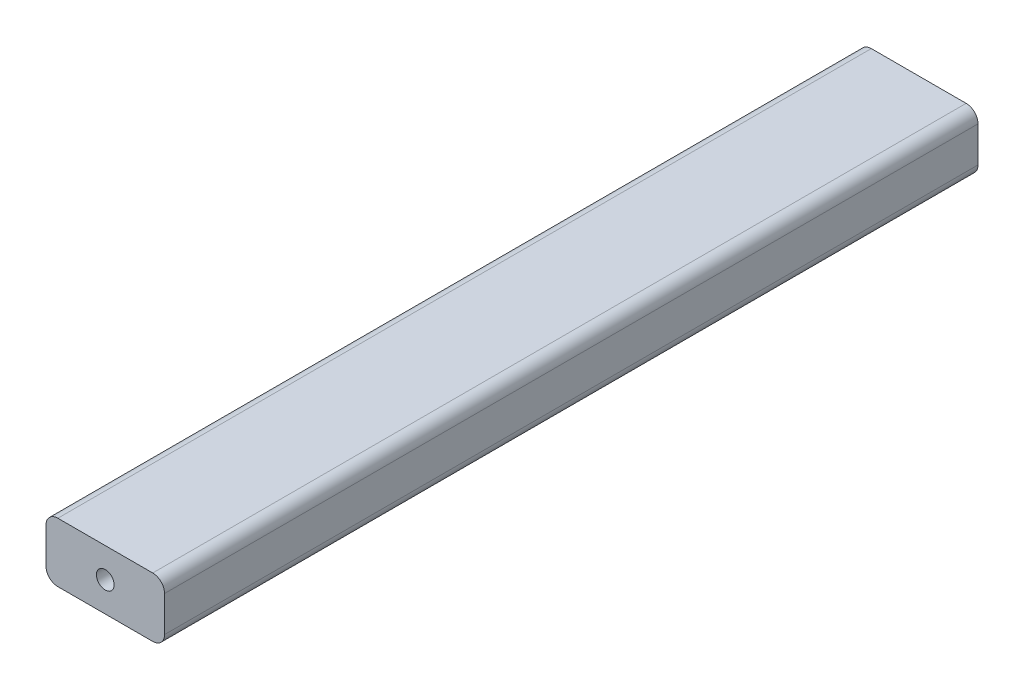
ISO-10303-21;
HEADER;
FILE_DESCRIPTION(('STEP AP214'),'2;1');
FILE_NAME('part.step','',(''),(''),'','','');
FILE_SCHEMA(('AUTOMOTIVE_DESIGN { 1 0 10303 214 1 1 1 1 }'));
ENDSEC;
DATA;
#1=APPLICATION_CONTEXT('core data for automotive mechanical design processes');
#2=APPLICATION_PROTOCOL_DEFINITION('international standard','automotive_design',2000,#1);
#3=PRODUCT_CONTEXT('',#1,'mechanical');
#4=PRODUCT('Part','Part','',(#3));
#5=PRODUCT_RELATED_PRODUCT_CATEGORY('part','',(#4));
#6=PRODUCT_DEFINITION_FORMATION('','',#4);
#7=PRODUCT_DEFINITION_CONTEXT('part definition',#1,'design');
#8=PRODUCT_DEFINITION('design','',#6,#7);
#9=PRODUCT_DEFINITION_SHAPE('','',#8);
#10=(LENGTH_UNIT() NAMED_UNIT(*) SI_UNIT(.MILLI.,.METRE.));
#11=(NAMED_UNIT(*) PLANE_ANGLE_UNIT() SI_UNIT($,.RADIAN.));
#12=(NAMED_UNIT(*) SI_UNIT($,.STERADIAN.) SOLID_ANGLE_UNIT());
#13=UNCERTAINTY_MEASURE_WITH_UNIT(LENGTH_MEASURE(1.E-05),#10,'distance_accuracy_value','');
#14=(GEOMETRIC_REPRESENTATION_CONTEXT(3) GLOBAL_UNCERTAINTY_ASSIGNED_CONTEXT((#13)) GLOBAL_UNIT_ASSIGNED_CONTEXT((#10,
#11,#12)) REPRESENTATION_CONTEXT('',''));
#15=CARTESIAN_POINT('',(0.,0.,0.));
#16=DIRECTION('',(0.,0.,1.));
#17=DIRECTION('',(1.,0.,0.));
#18=AXIS2_PLACEMENT_3D('',#15,#16,#17);
#19=CARTESIAN_POINT('',(-13.5890000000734,53.4416000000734,87.1347));
#20=DIRECTION('',(1.,0.,0.));
#21=DIRECTION('',(0.,1.,0.));
#22=AXIS2_PLACEMENT_3D('',#19,#20,#21);
#23=PLANE('',#22);
#24=DIRECTION('',(0.,-1.,0.));
#25=VECTOR('',#24,1.);
#26=CARTESIAN_POINT('',(-13.5890000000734,53.4416000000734,-87.1347));
#27=LINE('',#26,#25);
#28=CARTESIAN_POINT('',(-13.5890000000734,50.9016000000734,-87.1347));
#29=VERTEX_POINT('',#28);
#30=CARTESIAN_POINT('',(-13.5890000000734,43.2816000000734,-87.1347));
#31=VERTEX_POINT('',#30);
#32=EDGE_CURVE('E130',#29,#31,#27,.T.);
#33=ORIENTED_EDGE('',*,*,#32,.T.);
#34=DIRECTION('',(0.,0.,-1.));
#35=VECTOR('',#34,1.);
#36=CARTESIAN_POINT('',(-13.5890000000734,43.2816000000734,87.1347));
#37=LINE('',#36,#35);
#38=CARTESIAN_POINT('',(-13.5890000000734,43.2816000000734,87.1347));
#39=VERTEX_POINT('',#38);
#40=EDGE_CURVE('E167',#31,#39,#37,.F.);
#41=ORIENTED_EDGE('',*,*,#40,.T.);
#42=DIRECTION('',(0.,-1.,0.));
#43=VECTOR('',#42,1.);
#44=CARTESIAN_POINT('',(-13.5890000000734,53.4416000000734,87.1347));
#45=LINE('',#44,#43);
#46=CARTESIAN_POINT('',(-13.5890000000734,50.9016000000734,87.1347));
#47=VERTEX_POINT('',#46);
#48=EDGE_CURVE('E131',#47,#39,#45,.T.);
#49=ORIENTED_EDGE('',*,*,#48,.F.);
#50=DIRECTION('',(0.,0.,-1.));
#51=VECTOR('',#50,1.);
#52=CARTESIAN_POINT('',(-13.5890000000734,50.9016000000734,87.1347));
#53=LINE('',#52,#51);
#54=EDGE_CURVE('E164',#47,#29,#53,.T.);
#55=ORIENTED_EDGE('',*,*,#54,.T.);
#56=EDGE_LOOP('',(#33,#41,#49,#55));
#57=FACE_BOUND('',#56,.T.);
#58=ADVANCED_FACE('F38',(#57),#23,.F.);
#59=CARTESIAN_POINT('',(-13.5890000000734,40.7416000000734,87.1347));
#60=DIRECTION('',(0.,1.,0.));
#61=DIRECTION('',(0.,0.,1.));
#62=AXIS2_PLACEMENT_3D('',#59,#60,#61);
#63=PLANE('',#62);
#64=DIRECTION('',(1.,0.,0.));
#65=VECTOR('',#64,1.);
#66=CARTESIAN_POINT('',(-13.5890000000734,40.7416000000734,87.1347));
#67=LINE('',#66,#65);
#68=CARTESIAN_POINT('',(-11.0490000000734,40.7416000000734,87.1347));
#69=VERTEX_POINT('',#68);
#70=CARTESIAN_POINT('',(9.27099999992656,40.7416000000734,87.1347));
#71=VERTEX_POINT('',#70);
#72=EDGE_CURVE('E134',#69,#71,#67,.T.);
#73=ORIENTED_EDGE('',*,*,#72,.F.);
#74=DIRECTION('',(0.,0.,-1.));
#75=VECTOR('',#74,1.);
#76=CARTESIAN_POINT('',(-11.0490000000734,40.7416000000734,87.1347));
#77=LINE('',#76,#75);
#78=CARTESIAN_POINT('',(-11.0490000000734,40.7416000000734,-87.1347));
#79=VERTEX_POINT('',#78);
#80=EDGE_CURVE('E153',#69,#79,#77,.T.);
#81=ORIENTED_EDGE('',*,*,#80,.T.);
#82=DIRECTION('',(1.,0.,0.));
#83=VECTOR('',#82,1.);
#84=CARTESIAN_POINT('',(-13.5890000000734,40.7416000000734,-87.1347));
#85=LINE('',#84,#83);
#86=CARTESIAN_POINT('',(9.27099999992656,40.7416000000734,-87.1347));
#87=VERTEX_POINT('',#86);
#88=EDGE_CURVE('E145',#79,#87,#85,.T.);
#89=ORIENTED_EDGE('',*,*,#88,.T.);
#90=DIRECTION('',(0.,0.,-1.));
#91=VECTOR('',#90,1.);
#92=CARTESIAN_POINT('',(9.27099999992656,40.7416000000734,87.1347));
#93=LINE('',#92,#91);
#94=EDGE_CURVE('E142',#87,#71,#93,.F.);
#95=ORIENTED_EDGE('',*,*,#94,.T.);
#96=EDGE_LOOP('',(#73,#81,#89,#95));
#97=FACE_BOUND('',#96,.T.);
#98=ADVANCED_FACE('F208',(#97),#63,.F.);
#99=CARTESIAN_POINT('',(11.8109999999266,53.4416000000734,87.1347));
#100=DIRECTION('',(-1.,0.,0.));
#101=DIRECTION('',(0.,-1.,0.));
#102=AXIS2_PLACEMENT_3D('',#99,#100,#101);
#103=PLANE('',#102);
#104=DIRECTION('',(0.,1.,0.));
#105=VECTOR('',#104,1.);
#106=CARTESIAN_POINT('',(11.8109999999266,53.4416000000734,87.1347));
#107=LINE('',#106,#105);
#108=CARTESIAN_POINT('',(11.8109999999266,43.2816000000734,87.1347));
#109=VERTEX_POINT('',#108);
#110=CARTESIAN_POINT('',(11.8109999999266,50.9016000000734,87.1347));
#111=VERTEX_POINT('',#110);
#112=EDGE_CURVE('E138',#109,#111,#107,.T.);
#113=ORIENTED_EDGE('',*,*,#112,.F.);
#114=DIRECTION('',(0.,0.,-1.));
#115=VECTOR('',#114,1.);
#116=CARTESIAN_POINT('',(11.8109999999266,43.2816000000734,87.1347));
#117=LINE('',#116,#115);
#118=CARTESIAN_POINT('',(11.8109999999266,43.2816000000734,-87.1347));
#119=VERTEX_POINT('',#118);
#120=EDGE_CURVE('E11',#109,#119,#117,.T.);
#121=ORIENTED_EDGE('',*,*,#120,.T.);
#122=DIRECTION('',(0.,1.,0.));
#123=VECTOR('',#122,1.);
#124=CARTESIAN_POINT('',(11.8109999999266,53.4416000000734,-87.1347));
#125=LINE('',#124,#123);
#126=CARTESIAN_POINT('',(11.8109999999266,50.9016000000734,-87.1347));
#127=VERTEX_POINT('',#126);
#128=EDGE_CURVE('E148',#119,#127,#125,.T.);
#129=ORIENTED_EDGE('',*,*,#128,.T.);
#130=DIRECTION('',(0.,0.,-1.));
#131=VECTOR('',#130,1.);
#132=CARTESIAN_POINT('',(11.8109999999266,50.9016000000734,87.1347));
#133=LINE('',#132,#131);
#134=EDGE_CURVE('E46',#127,#111,#133,.F.);
#135=ORIENTED_EDGE('',*,*,#134,.T.);
#136=EDGE_LOOP('',(#113,#121,#129,#135));
#137=FACE_BOUND('',#136,.T.);
#138=ADVANCED_FACE('F182',(#137),#103,.F.);
#139=CARTESIAN_POINT('',(-13.5890000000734,53.4416000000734,87.1347));
#140=DIRECTION('',(0.,-1.,0.));
#141=DIRECTION('',(0.,0.,-1.));
#142=AXIS2_PLACEMENT_3D('',#139,#140,#141);
#143=PLANE('',#142);
#144=DIRECTION('',(-1.,0.,0.));
#145=VECTOR('',#144,1.);
#146=CARTESIAN_POINT('',(-13.5890000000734,53.4416000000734,-87.1347));
#147=LINE('',#146,#145);
#148=CARTESIAN_POINT('',(9.27099999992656,53.4416000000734,-87.1347));
#149=VERTEX_POINT('',#148);
#150=CARTESIAN_POINT('',(-11.0490000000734,53.4416000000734,-87.1347));
#151=VERTEX_POINT('',#150);
#152=EDGE_CURVE('E135',#149,#151,#147,.T.);
#153=ORIENTED_EDGE('',*,*,#152,.T.);
#154=DIRECTION('',(0.,0.,-1.));
#155=VECTOR('',#154,1.);
#156=CARTESIAN_POINT('',(-11.0490000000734,53.4416000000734,87.1347));
#157=LINE('',#156,#155);
#158=CARTESIAN_POINT('',(-11.0490000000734,53.4416000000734,87.1347));
#159=VERTEX_POINT('',#158);
#160=EDGE_CURVE('E53',#151,#159,#157,.F.);
#161=ORIENTED_EDGE('',*,*,#160,.T.);
#162=DIRECTION('',(-1.,0.,0.));
#163=VECTOR('',#162,1.);
#164=CARTESIAN_POINT('',(-13.5890000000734,53.4416000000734,87.1347));
#165=LINE('',#164,#163);
#166=CARTESIAN_POINT('',(9.27099999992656,53.4416000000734,87.1347));
#167=VERTEX_POINT('',#166);
#168=EDGE_CURVE('E140',#167,#159,#165,.T.);
#169=ORIENTED_EDGE('',*,*,#168,.F.);
#170=DIRECTION('',(0.,0.,-1.));
#171=VECTOR('',#170,1.);
#172=CARTESIAN_POINT('',(9.27099999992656,53.4416000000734,87.1347));
#173=LINE('',#172,#171);
#174=EDGE_CURVE('E176',#167,#149,#173,.T.);
#175=ORIENTED_EDGE('',*,*,#174,.T.);
#176=EDGE_LOOP('',(#153,#161,#169,#175));
#177=FACE_BOUND('',#176,.T.);
#178=ADVANCED_FACE('F190',(#177),#143,.F.);
#179=CARTESIAN_POINT('',(0.,0.,87.1347));
#180=DIRECTION('',(0.,0.,1.));
#181=DIRECTION('',(1.,0.,0.));
#182=AXIS2_PLACEMENT_3D('',#179,#180,#181);
#183=PLANE('',#182);
#184=CARTESIAN_POINT('',(-0.889000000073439,47.0916000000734,87.1347));
#185=DIRECTION('',(0.,0.,1.));
#186=DIRECTION('',(1.,0.,0.));
#187=AXIS2_PLACEMENT_3D('',#184,#185,#186);
#188=CIRCLE('',#187,1.89865);
#189=CARTESIAN_POINT('',(1.00964999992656,47.0916000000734,87.1347));
#190=VERTEX_POINT('',#189);
#191=EDGE_CURVE('E119',#190,#190,#188,.T.);
#192=ORIENTED_EDGE('',*,*,#191,.F.);
#193=EDGE_LOOP('',(#192));
#194=FACE_BOUND('',#193,.T.);
#195=ORIENTED_EDGE('',*,*,#48,.T.);
#196=CARTESIAN_POINT('',(-11.0490000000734,43.2816000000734,87.1347));
#197=DIRECTION('',(0.,0.,1.));
#198=DIRECTION('',(1.,0.,0.));
#199=AXIS2_PLACEMENT_3D('',#196,#197,#198);
#200=CIRCLE('',#199,2.54);
#201=EDGE_CURVE('E174',#39,#69,#200,.T.);
#202=ORIENTED_EDGE('',*,*,#201,.T.);
#203=ORIENTED_EDGE('',*,*,#72,.T.);
#204=CARTESIAN_POINT('',(9.27099999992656,43.2816000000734,87.1347));
#205=DIRECTION('',(0.,0.,1.));
#206=DIRECTION('',(1.,0.,0.));
#207=AXIS2_PLACEMENT_3D('',#204,#205,#206);
#208=CIRCLE('',#207,2.54);
#209=EDGE_CURVE('E170',#71,#109,#208,.T.);
#210=ORIENTED_EDGE('',*,*,#209,.T.);
#211=ORIENTED_EDGE('',*,*,#112,.T.);
#212=CARTESIAN_POINT('',(9.27099999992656,50.9016000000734,87.1347));
#213=DIRECTION('',(0.,0.,1.));
#214=DIRECTION('',(1.,0.,0.));
#215=AXIS2_PLACEMENT_3D('',#212,#213,#214);
#216=CIRCLE('',#215,2.54);
#217=EDGE_CURVE('E60',#111,#167,#216,.T.);
#218=ORIENTED_EDGE('',*,*,#217,.T.);
#219=ORIENTED_EDGE('',*,*,#168,.T.);
#220=CARTESIAN_POINT('',(-11.0490000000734,50.9016000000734,87.1347));
#221=DIRECTION('',(0.,0.,1.));
#222=DIRECTION('',(1.,0.,0.));
#223=AXIS2_PLACEMENT_3D('',#220,#221,#222);
#224=CIRCLE('',#223,2.54);
#225=EDGE_CURVE('E172',#159,#47,#224,.T.);
#226=ORIENTED_EDGE('',*,*,#225,.T.);
#227=EDGE_LOOP('',(#195,#202,#203,#210,#211,#218,#219,#226));
#228=FACE_BOUND('',#227,.T.);
#229=ADVANCED_FACE('F186',(#194,#228),#183,.T.);
#230=CARTESIAN_POINT('',(0.,0.,-87.1347));
#231=DIRECTION('',(0.,0.,1.));
#232=DIRECTION('',(1.,0.,0.));
#233=AXIS2_PLACEMENT_3D('',#230,#231,#232);
#234=PLANE('',#233);
#235=CARTESIAN_POINT('',(-0.889000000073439,47.0916000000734,-87.1347));
#236=DIRECTION('',(0.,0.,-1.));
#237=DIRECTION('',(-1.,0.,0.));
#238=AXIS2_PLACEMENT_3D('',#235,#236,#237);
#239=CIRCLE('',#238,1.89865);
#240=CARTESIAN_POINT('',(-2.78765000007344,47.0916000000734,-87.1347));
#241=VERTEX_POINT('',#240);
#242=EDGE_CURVE('E120',#241,#241,#239,.T.);
#243=ORIENTED_EDGE('',*,*,#242,.F.);
#244=EDGE_LOOP('',(#243));
#245=FACE_BOUND('',#244,.T.);
#246=ORIENTED_EDGE('',*,*,#88,.F.);
#247=CARTESIAN_POINT('',(-11.0490000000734,43.2816000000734,-87.1347));
#248=DIRECTION('',(0.,0.,1.));
#249=DIRECTION('',(1.,0.,0.));
#250=AXIS2_PLACEMENT_3D('',#247,#248,#249);
#251=CIRCLE('',#250,2.54);
#252=EDGE_CURVE('E162',#79,#31,#251,.F.);
#253=ORIENTED_EDGE('',*,*,#252,.T.);
#254=ORIENTED_EDGE('',*,*,#32,.F.);
#255=CARTESIAN_POINT('',(-11.0490000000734,50.9016000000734,-87.1347));
#256=DIRECTION('',(0.,0.,1.));
#257=DIRECTION('',(1.,0.,0.));
#258=AXIS2_PLACEMENT_3D('',#255,#256,#257);
#259=CIRCLE('',#258,2.54);
#260=EDGE_CURVE('E160',#29,#151,#259,.F.);
#261=ORIENTED_EDGE('',*,*,#260,.T.);
#262=ORIENTED_EDGE('',*,*,#152,.F.);
#263=CARTESIAN_POINT('',(9.27099999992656,50.9016000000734,-87.1347));
#264=DIRECTION('',(0.,0.,1.));
#265=DIRECTION('',(1.,0.,0.));
#266=AXIS2_PLACEMENT_3D('',#263,#264,#265);
#267=CIRCLE('',#266,2.54);
#268=EDGE_CURVE('E156',#149,#127,#267,.F.);
#269=ORIENTED_EDGE('',*,*,#268,.T.);
#270=ORIENTED_EDGE('',*,*,#128,.F.);
#271=CARTESIAN_POINT('',(9.27099999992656,43.2816000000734,-87.1347));
#272=DIRECTION('',(0.,0.,1.));
#273=DIRECTION('',(1.,0.,0.));
#274=AXIS2_PLACEMENT_3D('',#271,#272,#273);
#275=CIRCLE('',#274,2.54);
#276=EDGE_CURVE('E158',#119,#87,#275,.F.);
#277=ORIENTED_EDGE('',*,*,#276,.T.);
#278=EDGE_LOOP('',(#246,#253,#254,#261,#262,#269,#270,#277));
#279=FACE_BOUND('',#278,.T.);
#280=ADVANCED_FACE('F193',(#245,#279),#234,.F.);
#281=CARTESIAN_POINT('',(-11.0490000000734,43.2816000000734,87.1347));
#282=DIRECTION('',(0.,0.,-1.));
#283=DIRECTION('',(-1.,0.,0.));
#284=AXIS2_PLACEMENT_3D('',#281,#282,#283);
#285=CYLINDRICAL_SURFACE('',#284,2.54);
#286=ORIENTED_EDGE('',*,*,#201,.F.);
#287=ORIENTED_EDGE('',*,*,#40,.F.);
#288=ORIENTED_EDGE('',*,*,#252,.F.);
#289=ORIENTED_EDGE('',*,*,#80,.F.);
#290=EDGE_LOOP('',(#286,#287,#288,#289));
#291=FACE_BOUND('',#290,.T.);
#292=ADVANCED_FACE('F206',(#291),#285,.T.);
#293=CARTESIAN_POINT('',(-11.0490000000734,50.9016000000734,87.1347));
#294=DIRECTION('',(0.,0.,-1.));
#295=DIRECTION('',(-1.,0.,0.));
#296=AXIS2_PLACEMENT_3D('',#293,#294,#295);
#297=CYLINDRICAL_SURFACE('',#296,2.54);
#298=ORIENTED_EDGE('',*,*,#225,.F.);
#299=ORIENTED_EDGE('',*,*,#160,.F.);
#300=ORIENTED_EDGE('',*,*,#260,.F.);
#301=ORIENTED_EDGE('',*,*,#54,.F.);
#302=EDGE_LOOP('',(#298,#299,#300,#301));
#303=FACE_BOUND('',#302,.T.);
#304=ADVANCED_FACE('F198',(#303),#297,.T.);
#305=CARTESIAN_POINT('',(9.27099999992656,43.2816000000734,87.1347));
#306=DIRECTION('',(0.,0.,-1.));
#307=DIRECTION('',(-1.,0.,0.));
#308=AXIS2_PLACEMENT_3D('',#305,#306,#307);
#309=CYLINDRICAL_SURFACE('',#308,2.54);
#310=ORIENTED_EDGE('',*,*,#209,.F.);
#311=ORIENTED_EDGE('',*,*,#94,.F.);
#312=ORIENTED_EDGE('',*,*,#276,.F.);
#313=ORIENTED_EDGE('',*,*,#120,.F.);
#314=EDGE_LOOP('',(#310,#311,#312,#313));
#315=FACE_BOUND('',#314,.T.);
#316=ADVANCED_FACE('F211',(#315),#309,.T.);
#317=CARTESIAN_POINT('',(9.27099999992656,50.9016000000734,87.1347));
#318=DIRECTION('',(0.,0.,-1.));
#319=DIRECTION('',(-1.,0.,0.));
#320=AXIS2_PLACEMENT_3D('',#317,#318,#319);
#321=CYLINDRICAL_SURFACE('',#320,2.54);
#322=ORIENTED_EDGE('',*,*,#217,.F.);
#323=ORIENTED_EDGE('',*,*,#134,.F.);
#324=ORIENTED_EDGE('',*,*,#268,.F.);
#325=ORIENTED_EDGE('',*,*,#174,.F.);
#326=EDGE_LOOP('',(#322,#323,#324,#325));
#327=FACE_BOUND('',#326,.T.);
#328=ADVANCED_FACE('F40',(#327),#321,.T.);
#329=CARTESIAN_POINT('',(-0.889000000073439,47.0916000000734,72.1868));
#330=DIRECTION('',(0.,0.,1.));
#331=DIRECTION('',(1.,0.,0.));
#332=AXIS2_PLACEMENT_3D('',#329,#330,#331);
#333=CONICAL_SURFACE('',#332,1.89865,1.02974425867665);
#334=CARTESIAN_POINT('',(-0.889000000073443,47.0916000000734,71.0459759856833));
#335=VERTEX_POINT('',#334);
#336=VERTEX_LOOP('',#335);
#337=FACE_BOUND('',#336,.T.);
#338=CARTESIAN_POINT('',(-0.889000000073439,47.0916000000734,72.1868));
#339=DIRECTION('',(0.,0.,1.));
#340=DIRECTION('',(1.,0.,0.));
#341=AXIS2_PLACEMENT_3D('',#338,#339,#340);
#342=CIRCLE('',#341,1.89865);
#343=CARTESIAN_POINT('',(1.00964999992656,47.0916000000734,72.1868));
#344=VERTEX_POINT('',#343);
#345=EDGE_CURVE('E123',#344,#344,#342,.T.);
#346=ORIENTED_EDGE('',*,*,#345,.T.);
#347=EDGE_LOOP('',(#346));
#348=FACE_BOUND('',#347,.T.);
#349=ADVANCED_FACE('F217',(#337,#348),#333,.F.);
#350=CARTESIAN_POINT('',(-0.889000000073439,47.0916000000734,87.1347));
#351=DIRECTION('',(0.,0.,1.));
#352=DIRECTION('',(1.,0.,0.));
#353=AXIS2_PLACEMENT_3D('',#350,#351,#352);
#354=CYLINDRICAL_SURFACE('',#353,1.89865);
#355=ORIENTED_EDGE('',*,*,#345,.F.);
#356=EDGE_LOOP('',(#355));
#357=FACE_BOUND('',#356,.T.);
#358=ORIENTED_EDGE('',*,*,#191,.T.);
#359=EDGE_LOOP('',(#358));
#360=FACE_BOUND('',#359,.T.);
#361=ADVANCED_FACE('F113',(#357,#360),#354,.F.);
#362=CARTESIAN_POINT('',(-0.889000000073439,47.0916000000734,-72.1868));
#363=DIRECTION('',(0.,0.,-1.));
#364=DIRECTION('',(-1.,0.,0.));
#365=AXIS2_PLACEMENT_3D('',#362,#363,#364);
#366=CONICAL_SURFACE('',#365,1.89865,1.02974425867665);
#367=CARTESIAN_POINT('',(-0.889000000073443,47.0916000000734,-71.0459759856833));
#368=VERTEX_POINT('',#367);
#369=VERTEX_LOOP('',#368);
#370=FACE_BOUND('',#369,.T.);
#371=CARTESIAN_POINT('',(-0.889000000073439,47.0916000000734,-72.1868));
#372=DIRECTION('',(0.,0.,-1.));
#373=DIRECTION('',(-1.,0.,0.));
#374=AXIS2_PLACEMENT_3D('',#371,#372,#373);
#375=CIRCLE('',#374,1.89865);
#376=CARTESIAN_POINT('',(-2.78765000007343,47.0916000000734,-72.1868));
#377=VERTEX_POINT('',#376);
#378=EDGE_CURVE('E117',#377,#377,#375,.T.);
#379=ORIENTED_EDGE('',*,*,#378,.T.);
#380=EDGE_LOOP('',(#379));
#381=FACE_BOUND('',#380,.T.);
#382=ADVANCED_FACE('F109',(#370,#381),#366,.F.);
#383=CARTESIAN_POINT('',(-0.889000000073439,47.0916000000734,-87.1347));
#384=DIRECTION('',(0.,0.,-1.));
#385=DIRECTION('',(-1.,0.,0.));
#386=AXIS2_PLACEMENT_3D('',#383,#384,#385);
#387=CYLINDRICAL_SURFACE('',#386,1.89865);
#388=ORIENTED_EDGE('',*,*,#378,.F.);
#389=EDGE_LOOP('',(#388));
#390=FACE_BOUND('',#389,.T.);
#391=ORIENTED_EDGE('',*,*,#242,.T.);
#392=EDGE_LOOP('',(#391));
#393=FACE_BOUND('',#392,.T.);
#394=ADVANCED_FACE('F112',(#390,#393),#387,.F.);
#395=CLOSED_SHELL('',(#58,#98,#138,#178,#229,#280,#292,#304,#316,#328,#349,#361,#382,#394));
#396=MANIFOLD_SOLID_BREP('B2',#395);
#397=ADVANCED_BREP_SHAPE_REPRESENTATION('',(#18,#396),#14);
#398=SHAPE_DEFINITION_REPRESENTATION(#9,#397);
ENDSEC;
END-ISO-10303-21;
